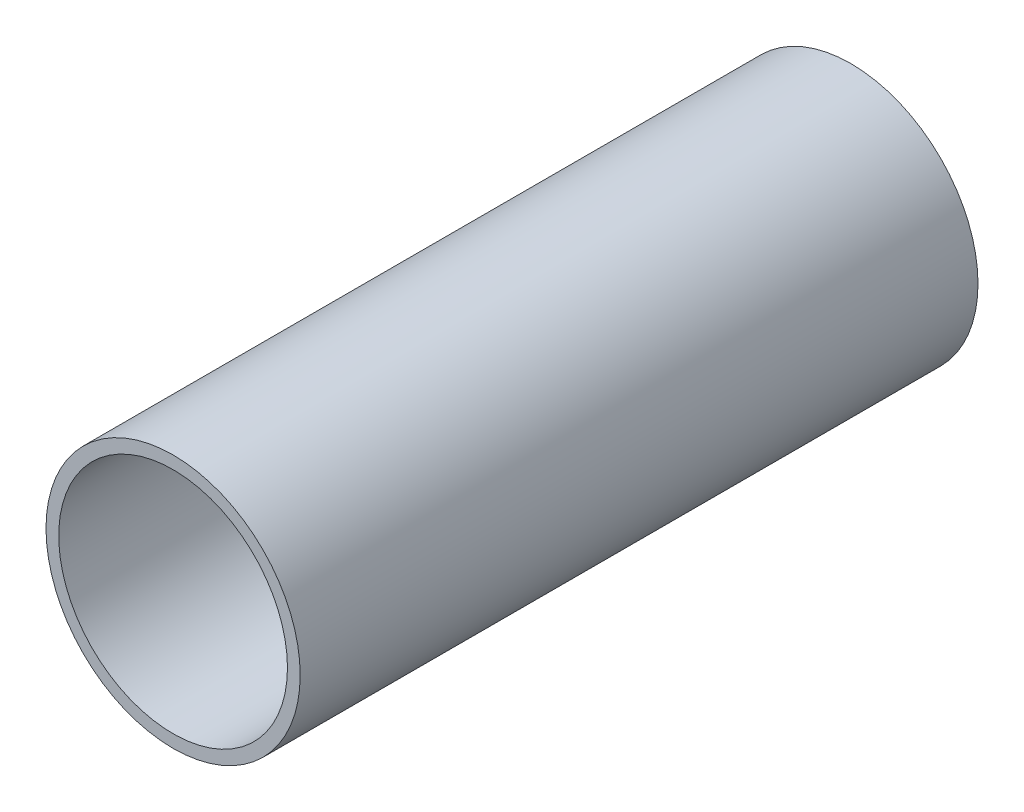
from build123d import *

# Parameters (mm, degrees)
ESQUISSE1_R      = 15
ESQUISSE1_R_2    = 13.5
EXTRUSION1_DEPTH = 80


with BuildPart() as part:
    # Esquisse1 → Extrusion1 (new body)
    with BuildSketch(Plane.XY):
        Circle(ESQUISSE1_R)
        Circle(ESQUISSE1_R_2, mode=Mode.SUBTRACT)
    extrude(amount=EXTRUSION1_DEPTH)


solid = part.part
